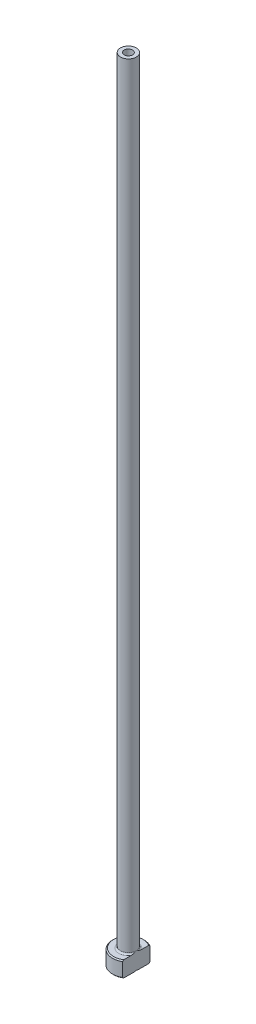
ISO-10303-21;
HEADER;
FILE_DESCRIPTION(('STEP AP214'),'2;1');
FILE_NAME('part.step','',(''),(''),'','','');
FILE_SCHEMA(('AUTOMOTIVE_DESIGN { 1 0 10303 214 1 1 1 1 }'));
ENDSEC;
DATA;
#1=APPLICATION_CONTEXT('core data for automotive mechanical design processes');
#2=APPLICATION_PROTOCOL_DEFINITION('international standard','automotive_design',2000,#1);
#3=PRODUCT_CONTEXT('',#1,'mechanical');
#4=PRODUCT('Part','Part','',(#3));
#5=PRODUCT_RELATED_PRODUCT_CATEGORY('part','',(#4));
#6=PRODUCT_DEFINITION_FORMATION('','',#4);
#7=PRODUCT_DEFINITION_CONTEXT('part definition',#1,'design');
#8=PRODUCT_DEFINITION('design','',#6,#7);
#9=PRODUCT_DEFINITION_SHAPE('','',#8);
#10=(LENGTH_UNIT() NAMED_UNIT(*) SI_UNIT(.MILLI.,.METRE.));
#11=(NAMED_UNIT(*) PLANE_ANGLE_UNIT() SI_UNIT($,.RADIAN.));
#12=(NAMED_UNIT(*) SI_UNIT($,.STERADIAN.) SOLID_ANGLE_UNIT());
#13=UNCERTAINTY_MEASURE_WITH_UNIT(LENGTH_MEASURE(1.E-05),#10,'distance_accuracy_value','');
#14=(GEOMETRIC_REPRESENTATION_CONTEXT(3) GLOBAL_UNCERTAINTY_ASSIGNED_CONTEXT((#13)) GLOBAL_UNIT_ASSIGNED_CONTEXT((#10,
#11,#12)) REPRESENTATION_CONTEXT('',''));
#15=CARTESIAN_POINT('',(0.,0.,0.));
#16=DIRECTION('',(0.,0.,1.));
#17=DIRECTION('',(1.,0.,0.));
#18=AXIS2_PLACEMENT_3D('',#15,#16,#17);
#19=CARTESIAN_POINT('',(0.,92.1876809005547,0.));
#20=DIRECTION('',(0.,1.,0.));
#21=DIRECTION('',(0.,0.,1.));
#22=AXIS2_PLACEMENT_3D('',#19,#20,#21);
#23=CYLINDRICAL_SURFACE('',#22,0.8);
#24=CARTESIAN_POINT('',(0.,150.,0.));
#25=DIRECTION('',(0.,1.,0.));
#26=DIRECTION('',(0.,0.,1.));
#27=AXIS2_PLACEMENT_3D('',#24,#25,#26);
#28=CIRCLE('',#27,0.8);
#29=CARTESIAN_POINT('',(0.,150.,0.8));
#30=VERTEX_POINT('',#29);
#31=EDGE_CURVE('E181',#30,#30,#28,.T.);
#32=ORIENTED_EDGE('',*,*,#31,.T.);
#33=EDGE_LOOP('',(#32));
#34=FACE_BOUND('',#33,.T.);
#35=CARTESIAN_POINT('',(0.,115.,0.));
#36=DIRECTION('',(0.,1.,0.));
#37=DIRECTION('',(0.,0.,1.));
#38=AXIS2_PLACEMENT_3D('',#35,#36,#37);
#39=CIRCLE('',#38,0.8);
#40=CARTESIAN_POINT('',(0.,115.,0.8));
#41=VERTEX_POINT('',#40);
#42=EDGE_CURVE('E152',#41,#41,#39,.T.);
#43=ORIENTED_EDGE('',*,*,#42,.F.);
#44=EDGE_LOOP('',(#43));
#45=FACE_BOUND('',#44,.T.);
#46=ADVANCED_FACE('F32',(#34,#45),#23,.F.);
#47=CARTESIAN_POINT('',(-0.8,150.,0.));
#48=DIRECTION('',(0.,1.,0.));
#49=DIRECTION('',(0.,0.,1.));
#50=AXIS2_PLACEMENT_3D('',#47,#48,#49);
#51=PLANE('',#50);
#52=CARTESIAN_POINT('',(0.,150.,0.));
#53=DIRECTION('',(0.,1.,0.));
#54=DIRECTION('',(0.,0.,1.));
#55=AXIS2_PLACEMENT_3D('',#52,#53,#54);
#56=CIRCLE('',#55,1.50000000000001);
#57=CARTESIAN_POINT('',(0.,150.,1.50000000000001));
#58=VERTEX_POINT('',#57);
#59=EDGE_CURVE('E187',#58,#58,#56,.T.);
#60=ORIENTED_EDGE('',*,*,#59,.T.);
#61=EDGE_LOOP('',(#60));
#62=FACE_BOUND('',#61,.T.);
#63=ORIENTED_EDGE('',*,*,#31,.F.);
#64=EDGE_LOOP('',(#63));
#65=FACE_BOUND('',#64,.T.);
#66=ADVANCED_FACE('F171',(#62,#65),#51,.T.);
#67=CARTESIAN_POINT('',(0.,92.1876809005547,0.));
#68=DIRECTION('',(0.,1.,0.));
#69=DIRECTION('',(0.,0.,1.));
#70=AXIS2_PLACEMENT_3D('',#67,#68,#69);
#71=CYLINDRICAL_SURFACE('',#70,1.5);
#72=CARTESIAN_POINT('',(0.,3.3,0.));
#73=DIRECTION('',(0.,1.,0.));
#74=DIRECTION('',(0.,0.,1.));
#75=AXIS2_PLACEMENT_3D('',#72,#73,#74);
#76=CIRCLE('',#75,1.5);
#77=CARTESIAN_POINT('',(1.5,3.3,0.));
#78=VERTEX_POINT('',#77);
#79=EDGE_CURVE('E194',#78,#78,#76,.T.);
#80=ORIENTED_EDGE('',*,*,#79,.T.);
#81=EDGE_LOOP('',(#80));
#82=FACE_BOUND('',#81,.T.);
#83=ORIENTED_EDGE('',*,*,#59,.F.);
#84=EDGE_LOOP('',(#83));
#85=FACE_BOUND('',#84,.T.);
#86=ADVANCED_FACE('F176',(#82,#85),#71,.T.);
#87=CARTESIAN_POINT('',(-1.49999999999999,3.,0.));
#88=DIRECTION('',(0.,1.,0.));
#89=DIRECTION('',(0.,0.,1.));
#90=AXIS2_PLACEMENT_3D('',#87,#88,#89);
#91=PLANE('',#90);
#92=DIRECTION('',(0.,0.,1.));
#93=VECTOR('',#92,1.);
#94=CARTESIAN_POINT('',(1.49999999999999,3.,0.));
#95=LINE('',#94,#93);
#96=CARTESIAN_POINT('',(1.5,3.,-2.36431808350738));
#97=VERTEX_POINT('',#96);
#98=CARTESIAN_POINT('',(1.49999999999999,3.,-0.994987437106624));
#99=VERTEX_POINT('',#98);
#100=EDGE_CURVE('E153',#97,#99,#95,.T.);
#101=ORIENTED_EDGE('',*,*,#100,.F.);
#102=CARTESIAN_POINT('',(0.,3.,0.));
#103=DIRECTION('',(0.,1.,0.));
#104=DIRECTION('',(0.,0.,1.));
#105=AXIS2_PLACEMENT_3D('',#102,#103,#104);
#106=CIRCLE('',#105,2.8);
#107=CARTESIAN_POINT('',(1.49999999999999,2.99999999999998,2.36431808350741));
#108=VERTEX_POINT('',#107);
#109=EDGE_CURVE('E200',#97,#108,#106,.T.);
#110=ORIENTED_EDGE('',*,*,#109,.T.);
#111=CARTESIAN_POINT('',(1.49999999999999,3.,0.994987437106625));
#112=VERTEX_POINT('',#111);
#113=EDGE_CURVE('E208',#112,#108,#95,.T.);
#114=ORIENTED_EDGE('',*,*,#113,.F.);
#115=CARTESIAN_POINT('',(0.,3.,0.));
#116=DIRECTION('',(0.,1.,0.));
#117=DIRECTION('',(0.,0.,1.));
#118=AXIS2_PLACEMENT_3D('',#115,#116,#117);
#119=CIRCLE('',#118,1.8);
#120=EDGE_CURVE('E197',#112,#99,#119,.F.);
#121=ORIENTED_EDGE('',*,*,#120,.T.);
#122=EDGE_LOOP('',(#101,#110,#114,#121));
#123=FACE_BOUND('',#122,.T.);
#124=ADVANCED_FACE('F219',(#123),#91,.T.);
#125=CARTESIAN_POINT('',(0.,92.1876809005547,0.));
#126=DIRECTION('',(0.,1.,0.));
#127=DIRECTION('',(0.,0.,1.));
#128=AXIS2_PLACEMENT_3D('',#125,#126,#127);
#129=CYLINDRICAL_SURFACE('',#128,2.99999999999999);
#130=DIRECTION('',(0.,-1.,0.));
#131=VECTOR('',#130,1.);
#132=CARTESIAN_POINT('',(1.49999999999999,150.,2.59807621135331));
#133=LINE('',#132,#131);
#134=CARTESIAN_POINT('',(1.49999999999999,2.80000000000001,2.59807621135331));
#135=VERTEX_POINT('',#134);
#136=CARTESIAN_POINT('',(1.49999999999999,0.200000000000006,2.59807621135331));
#137=VERTEX_POINT('',#136);
#138=EDGE_CURVE('E90',#135,#137,#133,.T.);
#139=ORIENTED_EDGE('',*,*,#138,.F.);
#140=CARTESIAN_POINT('',(0.,2.80000000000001,0.));
#141=DIRECTION('',(0.,1.,0.));
#142=DIRECTION('',(0.,0.,1.));
#143=AXIS2_PLACEMENT_3D('',#140,#141,#142);
#144=CIRCLE('',#143,2.99999999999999);
#145=CARTESIAN_POINT('',(1.5,2.80000000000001,-2.59807621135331));
#146=VERTEX_POINT('',#145);
#147=EDGE_CURVE('E106',#135,#146,#144,.F.);
#148=ORIENTED_EDGE('',*,*,#147,.T.);
#149=DIRECTION('',(0.,-1.,0.));
#150=VECTOR('',#149,1.);
#151=CARTESIAN_POINT('',(1.5,150.,-2.59807621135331));
#152=LINE('',#151,#150);
#153=CARTESIAN_POINT('',(1.5,0.200000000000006,-2.59807621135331));
#154=VERTEX_POINT('',#153);
#155=EDGE_CURVE('E206',#146,#154,#152,.T.);
#156=ORIENTED_EDGE('',*,*,#155,.T.);
#157=CARTESIAN_POINT('',(0.,0.200000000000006,0.));
#158=DIRECTION('',(0.,-1.,0.));
#159=DIRECTION('',(0.,0.,-1.));
#160=AXIS2_PLACEMENT_3D('',#157,#158,#159);
#161=CIRCLE('',#160,2.99999999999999);
#162=EDGE_CURVE('E109',#154,#137,#161,.F.);
#163=ORIENTED_EDGE('',*,*,#162,.T.);
#164=EDGE_LOOP('',(#139,#148,#156,#163));
#165=FACE_BOUND('',#164,.T.);
#166=ADVANCED_FACE('F204',(#165),#129,.T.);
#167=CARTESIAN_POINT('',(-2.99999999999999,0.,0.));
#168=DIRECTION('',(0.,-1.,0.));
#169=DIRECTION('',(0.,0.,-1.));
#170=AXIS2_PLACEMENT_3D('',#167,#168,#169);
#171=PLANE('',#170);
#172=DIRECTION('',(0.,0.,-1.));
#173=VECTOR('',#172,1.);
#174=CARTESIAN_POINT('',(1.49999999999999,0.,2.59807621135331));
#175=LINE('',#174,#173);
#176=CARTESIAN_POINT('',(1.49999999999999,0.,-0.390512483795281));
#177=VERTEX_POINT('',#176);
#178=CARTESIAN_POINT('',(1.5,0.,-2.36431808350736));
#179=VERTEX_POINT('',#178);
#180=EDGE_CURVE('E102',#177,#179,#175,.T.);
#181=ORIENTED_EDGE('',*,*,#180,.F.);
#182=CARTESIAN_POINT('',(0.,0.,0.));
#183=DIRECTION('',(0.,-1.,0.));
#184=DIRECTION('',(0.,0.,-1.));
#185=AXIS2_PLACEMENT_3D('',#182,#183,#184);
#186=CIRCLE('',#185,1.54999999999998);
#187=CARTESIAN_POINT('',(1.49999999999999,0.,0.390512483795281));
#188=VERTEX_POINT('',#187);
#189=EDGE_CURVE('E95',#177,#188,#186,.F.);
#190=ORIENTED_EDGE('',*,*,#189,.T.);
#191=CARTESIAN_POINT('',(1.49999999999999,0.,2.36431808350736));
#192=VERTEX_POINT('',#191);
#193=EDGE_CURVE('E88',#192,#188,#175,.T.);
#194=ORIENTED_EDGE('',*,*,#193,.F.);
#195=CARTESIAN_POINT('',(0.,0.,0.));
#196=DIRECTION('',(0.,-1.,0.));
#197=DIRECTION('',(0.,0.,-1.));
#198=AXIS2_PLACEMENT_3D('',#195,#196,#197);
#199=CIRCLE('',#198,2.79999999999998);
#200=EDGE_CURVE('E101',#192,#179,#199,.T.);
#201=ORIENTED_EDGE('',*,*,#200,.T.);
#202=EDGE_LOOP('',(#181,#190,#194,#201));
#203=FACE_BOUND('',#202,.T.);
#204=ADVANCED_FACE('F100',(#203),#171,.T.);
#205=CARTESIAN_POINT('',(0.,92.1876809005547,0.));
#206=DIRECTION('',(0.,1.,0.));
#207=DIRECTION('',(0.,0.,1.));
#208=AXIS2_PLACEMENT_3D('',#205,#206,#207);
#209=CYLINDRICAL_SURFACE('',#208,1.05);
#210=CARTESIAN_POINT('',(0.,0.5,0.));
#211=DIRECTION('',(0.,-1.,0.));
#212=DIRECTION('',(0.,0.,-1.));
#213=AXIS2_PLACEMENT_3D('',#210,#211,#212);
#214=CIRCLE('',#213,1.05);
#215=CARTESIAN_POINT('',(0.,0.5,-1.05));
#216=VERTEX_POINT('',#215);
#217=EDGE_CURVE('E11',#216,#216,#214,.T.);
#218=ORIENTED_EDGE('',*,*,#217,.T.);
#219=EDGE_LOOP('',(#218));
#220=FACE_BOUND('',#219,.T.);
#221=CARTESIAN_POINT('',(0.,103.,0.));
#222=DIRECTION('',(0.,1.,0.));
#223=DIRECTION('',(0.,0.,1.));
#224=AXIS2_PLACEMENT_3D('',#221,#222,#223);
#225=CIRCLE('',#224,1.05);
#226=CARTESIAN_POINT('',(0.,103.,1.05));
#227=VERTEX_POINT('',#226);
#228=EDGE_CURVE('E185',#227,#227,#225,.T.);
#229=ORIENTED_EDGE('',*,*,#228,.T.);
#230=EDGE_LOOP('',(#229));
#231=FACE_BOUND('',#230,.T.);
#232=ADVANCED_FACE('F232',(#220,#231),#209,.F.);
#233=CARTESIAN_POINT('',(0.,103.,0.));
#234=DIRECTION('',(0.,-1.,0.));
#235=DIRECTION('',(0.,0.,-1.));
#236=AXIS2_PLACEMENT_3D('',#233,#234,#235);
#237=CONICAL_SURFACE('',#236,1.05,0.0208303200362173);
#238=ORIENTED_EDGE('',*,*,#42,.T.);
#239=EDGE_LOOP('',(#238));
#240=FACE_BOUND('',#239,.T.);
#241=ORIENTED_EDGE('',*,*,#228,.F.);
#242=EDGE_LOOP('',(#241));
#243=FACE_BOUND('',#242,.T.);
#244=ADVANCED_FACE('F123',(#240,#243),#237,.F.);
#245=CARTESIAN_POINT('',(0.,3.3,0.));
#246=DIRECTION('',(0.,1.,0.));
#247=DIRECTION('',(0.,0.,1.));
#248=AXIS2_PLACEMENT_3D('',#245,#246,#247);
#249=TOROIDAL_SURFACE('',#248,1.8,0.3);
#250=ORIENTED_EDGE('',*,*,#120,.F.);
#251=CARTESIAN_POINT('',(1.5,3.3,0.));
#252=CARTESIAN_POINT('',(1.5,3.30000063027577,-3.4193899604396E-12));
#253=CARTESIAN_POINT('',(1.5,3.30000126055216,1.15373666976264E-07));
#254=CARTESIAN_POINT('',(1.5,3.30000248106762,4.90631662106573E-07));
#255=CARTESIAN_POINT('',(1.5,3.30000307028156,7.53296792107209E-07));
#256=CARTESIAN_POINT('',(1.5,3.30000424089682,1.38757115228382E-06));
#257=CARTESIAN_POINT('',(1.5,3.30000481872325,1.76563024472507E-06));
#258=CARTESIAN_POINT('',(1.5,3.30000591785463,2.58768036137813E-06));
#259=CARTESIAN_POINT('',(1.5,3.30000643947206,3.03127045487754E-06));
#260=CARTESIAN_POINT('',(1.5,3.30000815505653,4.60022013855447E-06));
#261=CARTESIAN_POINT('',(1.5,3.30000927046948,5.81241577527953E-06));
#262=CARTESIAN_POINT('',(1.5,3.30001128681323,8.33989483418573E-06));
#263=CARTESIAN_POINT('',(1.5,3.3000121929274,9.65128228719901E-06));
#264=CARTESIAN_POINT('',(1.5,3.30001551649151,1.46782517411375E-05));
#265=CARTESIAN_POINT('',(1.5,3.30001775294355,1.85179784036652E-05));
#266=CARTESIAN_POINT('',(1.5,3.3000214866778,2.61616212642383E-05));
#267=CARTESIAN_POINT('',(1.5,3.30002302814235,2.99447760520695E-05));
#268=CARTESIAN_POINT('',(1.5,3.30002943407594,4.58003773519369E-05));
#269=CARTESIAN_POINT('',(1.5,3.30003419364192,5.79079117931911E-05));
#270=CARTESIAN_POINT('',(1.5,3.30004197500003,8.07263804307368E-05));
#271=CARTESIAN_POINT('',(1.5,3.30004514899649,9.13834757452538E-05));
#272=CARTESIAN_POINT('',(1.49999999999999,3.30006989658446,0.000167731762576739));
#273=CARTESIAN_POINT('',(1.49999999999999,3.30010092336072,0.000229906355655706));
#274=CARTESIAN_POINT('',(1.5,3.30021632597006,0.000470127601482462));
#275=CARTESIAN_POINT('',(1.5,3.3002936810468,0.000650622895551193));
#276=CARTESIAN_POINT('',(1.49999999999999,3.30059619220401,0.00134589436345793));
#277=CARTESIAN_POINT('',(1.49999999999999,3.30082870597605,0.00185814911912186));
#278=CARTESIAN_POINT('',(1.5,3.30176696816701,0.00393547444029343));
#279=CARTESIAN_POINT('',(1.5,3.30246445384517,0.00550332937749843));
#280=CARTESIAN_POINT('',(1.49999999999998,3.3142678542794,0.0320229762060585));
#281=CARTESIAN_POINT('',(1.49999999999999,3.32544800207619,0.0569503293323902));
#282=CARTESIAN_POINT('',(1.5,3.34725700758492,0.105984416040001));
#283=CARTESIAN_POINT('',(1.5,3.35789134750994,0.130088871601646));
#284=CARTESIAN_POINT('',(1.49999999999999,3.38015321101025,0.181096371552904));
#285=CARTESIAN_POINT('',(1.49999999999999,3.39175804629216,0.208009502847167));
#286=CARTESIAN_POINT('',(1.5,3.41469034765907,0.262264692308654));
#287=CARTESIAN_POINT('',(1.49999999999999,3.42601398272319,0.289608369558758));
#288=CARTESIAN_POINT('',(1.49999999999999,3.45363212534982,0.358203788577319));
#289=CARTESIAN_POINT('',(1.49999999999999,3.46959026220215,0.399592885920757));
#290=CARTESIAN_POINT('',(1.49999999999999,3.49940505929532,0.482097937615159));
#291=CARTESIAN_POINT('',(1.49999999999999,3.51330033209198,0.523199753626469));
#292=CARTESIAN_POINT('',(1.49999999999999,3.5355250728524,0.595497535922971));
#293=CARTESIAN_POINT('',(1.49999999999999,3.54436834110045,0.626532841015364));
#294=CARTESIAN_POINT('',(1.49999999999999,3.56052427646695,0.689176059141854));
#295=CARTESIAN_POINT('',(1.49999999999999,3.56782794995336,0.720786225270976));
#296=CARTESIAN_POINT('',(1.49999999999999,3.5875075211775,0.819524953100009));
#297=CARTESIAN_POINT('',(1.49999999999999,3.59661044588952,0.887429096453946));
#298=CARTESIAN_POINT('',(1.49999999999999,3.60059842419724,0.99118029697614));
#299=CARTESIAN_POINT('',(1.49999999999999,3.60019840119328,1.02684364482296));
#300=CARTESIAN_POINT('',(1.49999999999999,3.5949708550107,1.09750559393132));
#301=CARTESIAN_POINT('',(1.49999999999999,3.5901929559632,1.13250716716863));
#302=CARTESIAN_POINT('',(1.49999999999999,3.57687734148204,1.19353096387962));
#303=CARTESIAN_POINT('',(1.49999999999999,3.56943875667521,1.21978854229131));
#304=CARTESIAN_POINT('',(1.49999999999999,3.55063748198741,1.27094658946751));
#305=CARTESIAN_POINT('',(1.49999999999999,3.53927342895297,1.29584658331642));
#306=CARTESIAN_POINT('',(1.49999999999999,3.51660016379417,1.33501873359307));
#307=CARTESIAN_POINT('',(1.49999999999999,3.50657738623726,1.35003296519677));
#308=CARTESIAN_POINT('',(1.49999999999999,3.48437469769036,1.37837252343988));
#309=CARTESIAN_POINT('',(1.49999999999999,3.47219867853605,1.39170082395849));
#310=CARTESIAN_POINT('',(1.49999999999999,3.44835614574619,1.41349417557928));
#311=CARTESIAN_POINT('',(1.49999999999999,3.43709185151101,1.42239673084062));
#312=CARTESIAN_POINT('',(1.49999999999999,3.41325256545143,1.43825467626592));
#313=CARTESIAN_POINT('',(1.49999999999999,3.40067804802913,1.44521076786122));
#314=CARTESIAN_POINT('',(1.49999999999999,3.37433767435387,1.45677158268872));
#315=CARTESIAN_POINT('',(1.49999999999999,3.36056203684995,1.46135438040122));
#316=CARTESIAN_POINT('',(1.49999999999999,3.33237324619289,1.46767730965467));
#317=CARTESIAN_POINT('',(1.49999999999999,3.31796076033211,1.46942034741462));
#318=CARTESIAN_POINT('',(1.49999999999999,3.29122479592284,1.46987207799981));
#319=CARTESIAN_POINT('',(1.49999999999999,3.2789066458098,1.46899029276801));
#320=CARTESIAN_POINT('',(1.49999999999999,3.25461019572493,1.4651157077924));
#321=CARTESIAN_POINT('',(1.49999999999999,3.24263187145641,1.46212305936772));
#322=CARTESIAN_POINT('',(1.49999999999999,3.2195968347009,1.4543117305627));
#323=CARTESIAN_POINT('',(1.49999999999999,3.20852542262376,1.44953579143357));
#324=CARTESIAN_POINT('',(1.49999999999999,3.18721125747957,1.43840957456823));
#325=CARTESIAN_POINT('',(1.49999999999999,3.17696878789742,1.43205876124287));
#326=CARTESIAN_POINT('',(1.49999999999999,3.15325976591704,1.41506353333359));
#327=CARTESIAN_POINT('',(1.49999999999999,3.14027750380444,1.40374235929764));
#328=CARTESIAN_POINT('',(1.49999999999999,3.11630720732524,1.37914825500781));
#329=CARTESIAN_POINT('',(1.49999999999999,3.10532420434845,1.36587054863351));
#330=CARTESIAN_POINT('',(1.49999999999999,3.08100891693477,1.33197272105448));
#331=CARTESIAN_POINT('',(1.49999999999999,3.0686762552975,1.3106384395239));
#332=CARTESIAN_POINT('',(1.49999999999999,3.04751867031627,1.26637455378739));
#333=CARTESIAN_POINT('',(1.49999999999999,3.038692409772,1.24344556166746));
#334=CARTESIAN_POINT('',(1.49999999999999,3.0197836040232,1.18316534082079));
#335=CARTESIAN_POINT('',(1.49999999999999,3.01191472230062,1.14512623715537));
#336=CARTESIAN_POINT('',(1.49999999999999,3.0018828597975,1.06789971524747));
#337=CARTESIAN_POINT('',(1.49999999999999,2.99979735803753,1.02870374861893));
#338=CARTESIAN_POINT('',(1.49999999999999,3.00021727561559,0.953160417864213));
#339=CARTESIAN_POINT('',(1.49999999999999,3.00240673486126,0.916808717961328));
#340=CARTESIAN_POINT('',(1.49999999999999,3.00996433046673,0.844432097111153));
#341=CARTESIAN_POINT('',(1.49999999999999,3.01533462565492,0.808407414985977));
#342=CARTESIAN_POINT('',(1.49999999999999,3.02828086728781,0.738670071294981));
#343=CARTESIAN_POINT('',(1.49999999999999,3.03573028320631,0.704933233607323));
#344=CARTESIAN_POINT('',(1.49999999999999,3.05243174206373,0.63812804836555));
#345=CARTESIAN_POINT('',(1.49999999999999,3.06167285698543,0.60505692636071));
#346=CARTESIAN_POINT('',(1.49999999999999,3.08440652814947,0.530195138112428));
#347=CARTESIAN_POINT('',(1.49999999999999,3.0983657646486,0.488547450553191));
#348=CARTESIAN_POINT('',(1.49999999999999,3.12838209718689,0.404954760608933));
#349=CARTESIAN_POINT('',(1.49999999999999,3.14447968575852,0.363024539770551));
#350=CARTESIAN_POINT('',(1.5,3.17238454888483,0.293508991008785));
#351=CARTESIAN_POINT('',(1.5,3.18384249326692,0.265781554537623));
#352=CARTESIAN_POINT('',(1.49999999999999,3.2070585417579,0.210769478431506));
#353=CARTESIAN_POINT('',(1.49999999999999,3.21881265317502,0.183483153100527));
#354=CARTESIAN_POINT('',(1.5,3.24136702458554,0.131772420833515));
#355=CARTESIAN_POINT('',(1.5,3.2521436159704,0.107337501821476));
#356=CARTESIAN_POINT('',(1.49999999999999,3.2742474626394,0.057632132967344));
#357=CARTESIAN_POINT('',(1.49999999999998,3.28558038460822,0.0323640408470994));
#358=CARTESIAN_POINT('',(1.5,3.29753556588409,0.00550327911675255));
#359=CARTESIAN_POINT('',(1.5,3.29823307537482,0.00393537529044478));
#360=CARTESIAN_POINT('',(1.49999999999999,3.29917134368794,0.00185803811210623));
#361=CARTESIAN_POINT('',(1.49999999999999,3.29940384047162,0.00134582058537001));
#362=CARTESIAN_POINT('',(1.5,3.2997063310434,0.00065059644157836));
#363=CARTESIAN_POINT('',(1.5,3.29978368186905,0.000470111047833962));
#364=CARTESIAN_POINT('',(1.49999999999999,3.29989907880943,0.000229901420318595));
#365=CARTESIAN_POINT('',(1.49999999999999,3.29993010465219,0.000167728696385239));
#366=CARTESIAN_POINT('',(1.5,3.2999548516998,9.13825741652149E-05));
#367=CARTESIAN_POINT('',(1.5,3.29995802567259,8.07256293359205E-05));
#368=CARTESIAN_POINT('',(1.5,3.29996580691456,5.79074863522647E-05));
#369=CARTESIAN_POINT('',(1.5,3.29997056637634,4.58001230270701E-05));
#370=CARTESIAN_POINT('',(1.5,3.29997697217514,2.99447140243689E-05));
#371=CARTESIAN_POINT('',(1.5,3.2999785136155,2.61615837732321E-05));
#372=CARTESIAN_POINT('',(1.5,3.29998224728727,1.85179862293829E-05));
#373=CARTESIAN_POINT('',(1.5,3.2999844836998,1.4678279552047E-05));
#374=CARTESIAN_POINT('',(1.5,3.2999878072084,9.65132837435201E-06));
#375=CARTESIAN_POINT('',(1.5,3.29998871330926,8.33994284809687E-06));
#376=CARTESIAN_POINT('',(1.5,3.29999072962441,5.81246495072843E-06));
#377=CARTESIAN_POINT('',(1.5,3.29999184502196,4.60026844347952E-06));
#378=CARTESIAN_POINT('',(1.5,3.29999356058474,3.03131433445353E-06));
#379=CARTESIAN_POINT('',(1.5,3.2999940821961,2.58772232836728E-06));
#380=CARTESIAN_POINT('',(1.5,3.29999518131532,1.76566730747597E-06));
#381=CARTESIAN_POINT('',(1.5,3.29999575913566,1.3876052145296E-06));
#382=CARTESIAN_POINT('',(1.5,3.2999969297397,7.53323585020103E-07));
#383=CARTESIAN_POINT('',(1.5,3.2999975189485,4.90654307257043E-07));
#384=CARTESIAN_POINT('',(1.5,3.29999873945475,1.15386308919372E-07));
#385=CARTESIAN_POINT('',(1.5,3.29999936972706,3.41962499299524E-12));
#386=CARTESIAN_POINT('',(1.5,3.3,0.));
#387=B_SPLINE_CURVE_WITH_KNOTS('',3,(#251,#252,#253,#254,#255,#256,#257,#258,#259,#260,#261,
#262,#263,#264,#265,#266,#267,#268,#269,#270,#271,#272,#273,#274,#275,#276,#277,#278,#279,#280,
#281,#282,#283,#284,#285,#286,#287,#288,#289,#290,#291,#292,#293,#294,#295,#296,#297,#298,#299,
#300,#301,#302,#303,#304,#305,#306,#307,#308,#309,#310,#311,#312,#313,#314,#315,#316,#317,#318,
#319,#320,#321,#322,#323,#324,#325,#326,#327,#328,#329,#330,#331,#332,#333,#334,#335,#336,#337,
#338,#339,#340,#341,#342,#343,#344,#345,#346,#347,#348,#349,#350,#351,#352,#353,#354,#355,#356,
#357,#358,#359,#360,#361,#362,#363,#364,#365,#366,#367,#368,#369,#370,#371,#372,#373,#374,#375,
#376,#377,#378,#379,#380,#381,#382,#383,#384,#385,#386),.UNSPECIFIED.,.T.,.F.,(4,2,2,2,2,2,2,2,
2,2,2,2,2,2,2,2,2,2,2,2,2,2,2,2,2,2,2,2,2,2,2,2,2,2,2,2,2,2,2,2,2,2,2,2,2,2,2,2,2,2,2,2,2,2,2,2,
2,2,2,2,2,2,2,2,2,2,2,4),(0.,1.88905974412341E-06,3.81509471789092E-06,5.87892670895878E-06,
7.93061809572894E-06,1.28480863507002E-05,1.76261683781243E-05,3.09099150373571E-05,
4.3152970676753E-05,8.21699299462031E-05,0.00011549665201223,0.000323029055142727,
0.000912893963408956,0.00259963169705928,0.00774858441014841,0.0896975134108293,
0.168737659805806,0.256660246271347,0.345444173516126,0.47849253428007,0.608603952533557,
0.70537288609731,0.802692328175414,1.00719557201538,1.11399616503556,1.21960092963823,
1.30124317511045,1.38291380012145,1.43690814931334,1.49080588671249,1.53371524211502,
1.57660911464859,1.61989249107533,1.66313154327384,1.69999492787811,1.73685567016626,
1.77288440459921,1.80892540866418,1.86031324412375,1.91182866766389,1.98534297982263,
2.05882922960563,2.17471722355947,2.29215041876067,2.40123170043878,2.51038710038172,
2.61397263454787,2.71694519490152,2.84866234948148,2.98337525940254,3.07337666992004,
3.16250453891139,3.24262397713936,3.32569301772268,3.33084213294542,3.33252874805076,
3.33311858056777,3.3333261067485,3.3333594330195,3.33339844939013,3.33341069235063,
3.33342397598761,3.33342875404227,3.33343367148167,3.33343572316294,3.33343778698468,
3.33343971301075,3.33344160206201),.UNSPECIFIED.);
#388=EDGE_CURVE('E138',#112,#78,#387,.T.);
#389=ORIENTED_EDGE('',*,*,#388,.T.);
#390=ORIENTED_EDGE('',*,*,#79,.F.);
#391=CARTESIAN_POINT('',(1.5,3.3,0.));
#392=CARTESIAN_POINT('',(1.5,3.29999936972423,3.41971501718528E-12));
#393=CARTESIAN_POINT('',(1.5,3.29999873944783,-1.15373666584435E-07));
#394=CARTESIAN_POINT('',(1.5,3.29999751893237,-4.90631661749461E-07));
#395=CARTESIAN_POINT('',(1.5,3.29999692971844,-7.53296791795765E-07));
#396=CARTESIAN_POINT('',(1.5,3.29999575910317,-1.38757115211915E-06));
#397=CARTESIAN_POINT('',(1.5,3.29999518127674,-1.76563024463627E-06));
#398=CARTESIAN_POINT('',(1.5,3.29999408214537,-2.58768036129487E-06));
#399=CARTESIAN_POINT('',(1.5,3.29999356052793,-3.03127045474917E-06));
#400=CARTESIAN_POINT('',(1.5,3.29999184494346,-4.60022013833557E-06));
#401=CARTESIAN_POINT('',(1.5,3.29999072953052,-5.81241577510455E-06));
#402=CARTESIAN_POINT('',(1.5,3.29998871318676,-8.33989483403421E-06));
#403=CARTESIAN_POINT('',(1.5,3.2999878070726,-9.65128228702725E-06));
#404=CARTESIAN_POINT('',(1.5,3.29998448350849,-1.46782517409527E-05));
#405=CARTESIAN_POINT('',(1.5,3.29998224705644,-1.85179784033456E-05));
#406=CARTESIAN_POINT('',(1.5,3.29997851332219,-2.61616212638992E-05));
#407=CARTESIAN_POINT('',(1.5,3.29997697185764,-2.99447760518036E-05));
#408=CARTESIAN_POINT('',(1.5,3.29997056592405,-4.58003773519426E-05));
#409=CARTESIAN_POINT('',(1.5,3.29996580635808,-5.79079117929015E-05));
#410=CARTESIAN_POINT('',(1.5,3.29995802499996,-8.07263804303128E-05));
#411=CARTESIAN_POINT('',(1.5,3.29995485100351,-9.13834757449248E-05));
#412=CARTESIAN_POINT('',(1.49999999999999,3.29993010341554,-0.000167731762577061));
#413=CARTESIAN_POINT('',(1.49999999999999,3.29989907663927,-0.000229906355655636));
#414=CARTESIAN_POINT('',(1.5,3.29978367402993,-0.000470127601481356));
#415=CARTESIAN_POINT('',(1.5,3.2997063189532,-0.000650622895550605));
#416=CARTESIAN_POINT('',(1.49999999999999,3.29940380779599,-0.00134589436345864));
#417=CARTESIAN_POINT('',(1.49999999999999,3.29917129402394,-0.00185814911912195));
#418=CARTESIAN_POINT('',(1.5,3.29823303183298,-0.003935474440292));
#419=CARTESIAN_POINT('',(1.5,3.29753554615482,-0.0055033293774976));
#420=CARTESIAN_POINT('',(1.49999999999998,3.28573214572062,-0.0320229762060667));
#421=CARTESIAN_POINT('',(1.49999999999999,3.27455199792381,-0.0569503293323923));
#422=CARTESIAN_POINT('',(1.5,3.25274299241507,-0.105984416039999));
#423=CARTESIAN_POINT('',(1.5,3.24210865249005,-0.130088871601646));
#424=CARTESIAN_POINT('',(1.49999999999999,3.21984678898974,-0.181096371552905));
#425=CARTESIAN_POINT('',(1.49999999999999,3.20824195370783,-0.208009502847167));
#426=CARTESIAN_POINT('',(1.5,3.18530965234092,-0.262264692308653));
#427=CARTESIAN_POINT('',(1.5,3.17398601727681,-0.289608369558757));
#428=CARTESIAN_POINT('',(1.49999999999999,3.14636787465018,-0.358203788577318));
#429=CARTESIAN_POINT('',(1.49999999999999,3.13040973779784,-0.399592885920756));
#430=CARTESIAN_POINT('',(1.49999999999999,3.10059494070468,-0.482097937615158));
#431=CARTESIAN_POINT('',(1.49999999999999,3.08669966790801,-0.523199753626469));
#432=CARTESIAN_POINT('',(1.49999999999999,3.06447492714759,-0.595497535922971));
#433=CARTESIAN_POINT('',(1.49999999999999,3.05563165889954,-0.626532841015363));
#434=CARTESIAN_POINT('',(1.49999999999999,3.03947572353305,-0.689176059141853));
#435=CARTESIAN_POINT('',(1.49999999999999,3.03217205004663,-0.720786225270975));
#436=CARTESIAN_POINT('',(1.49999999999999,3.0124924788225,-0.819524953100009));
#437=CARTESIAN_POINT('',(1.49999999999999,3.00338955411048,-0.887429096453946));
#438=CARTESIAN_POINT('',(1.49999999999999,2.99940157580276,-0.99118029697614));
#439=CARTESIAN_POINT('',(1.49999999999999,2.99980159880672,-1.02684364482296));
#440=CARTESIAN_POINT('',(1.49999999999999,3.0050291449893,-1.09750559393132));
#441=CARTESIAN_POINT('',(1.49999999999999,3.00980704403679,-1.13250716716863));
#442=CARTESIAN_POINT('',(1.49999999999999,3.02312265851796,-1.19353096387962));
#443=CARTESIAN_POINT('',(1.49999999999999,3.03056124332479,-1.21978854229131));
#444=CARTESIAN_POINT('',(1.49999999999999,3.04936251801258,-1.27094658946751));
#445=CARTESIAN_POINT('',(1.5,3.06072657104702,-1.29584658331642));
#446=CARTESIAN_POINT('',(1.5,3.08339983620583,-1.33501873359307));
#447=CARTESIAN_POINT('',(1.5,3.09342261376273,-1.35003296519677));
#448=CARTESIAN_POINT('',(1.5,3.11562530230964,-1.37837252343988));
#449=CARTESIAN_POINT('',(1.5,3.12780132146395,-1.39170082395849));
#450=CARTESIAN_POINT('',(1.5,3.15164385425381,-1.41349417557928));
#451=CARTESIAN_POINT('',(1.5,3.16290814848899,-1.42239673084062));
#452=CARTESIAN_POINT('',(1.5,3.18674743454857,-1.43825467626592));
#453=CARTESIAN_POINT('',(1.5,3.19932195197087,-1.44521076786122));
#454=CARTESIAN_POINT('',(1.5,3.22566232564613,-1.45677158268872));
#455=CARTESIAN_POINT('',(1.5,3.23943796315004,-1.46135438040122));
#456=CARTESIAN_POINT('',(1.5,3.26762675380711,-1.46767730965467));
#457=CARTESIAN_POINT('',(1.5,3.28203923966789,-1.46942034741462));
#458=CARTESIAN_POINT('',(1.5,3.30877520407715,-1.46987207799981));
#459=CARTESIAN_POINT('',(1.5,3.3210933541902,-1.46899029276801));
#460=CARTESIAN_POINT('',(1.5,3.34538980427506,-1.4651157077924));
#461=CARTESIAN_POINT('',(1.5,3.35736812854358,-1.46212305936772));
#462=CARTESIAN_POINT('',(1.5,3.38040316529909,-1.4543117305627));
#463=CARTESIAN_POINT('',(1.5,3.39147457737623,-1.44953579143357));
#464=CARTESIAN_POINT('',(1.5,3.41278874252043,-1.43840957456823));
#465=CARTESIAN_POINT('',(1.5,3.42303121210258,-1.43205876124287));
#466=CARTESIAN_POINT('',(1.5,3.44674023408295,-1.41506353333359));
#467=CARTESIAN_POINT('',(1.5,3.45972249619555,-1.40374235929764));
#468=CARTESIAN_POINT('',(1.5,3.48369279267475,-1.37914825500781));
#469=CARTESIAN_POINT('',(1.5,3.49467579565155,-1.36587054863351));
#470=CARTESIAN_POINT('',(1.5,3.51899108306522,-1.33197272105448));
#471=CARTESIAN_POINT('',(1.49999999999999,3.53132374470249,-1.3106384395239));
#472=CARTESIAN_POINT('',(1.49999999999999,3.55248132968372,-1.26637455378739));
#473=CARTESIAN_POINT('',(1.49999999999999,3.56130759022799,-1.24344556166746));
#474=CARTESIAN_POINT('',(1.49999999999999,3.5802163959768,-1.18316534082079));
#475=CARTESIAN_POINT('',(1.49999999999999,3.58808527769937,-1.14512623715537));
#476=CARTESIAN_POINT('',(1.49999999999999,3.5981171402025,-1.06789971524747));
#477=CARTESIAN_POINT('',(1.49999999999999,3.60020264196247,-1.02870374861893));
#478=CARTESIAN_POINT('',(1.49999999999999,3.59978272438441,-0.953160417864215));
#479=CARTESIAN_POINT('',(1.49999999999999,3.59759326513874,-0.916808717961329));
#480=CARTESIAN_POINT('',(1.49999999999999,3.59003566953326,-0.844432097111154));
#481=CARTESIAN_POINT('',(1.49999999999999,3.58466537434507,-0.808407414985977));
#482=CARTESIAN_POINT('',(1.49999999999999,3.57171913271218,-0.738670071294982));
#483=CARTESIAN_POINT('',(1.49999999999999,3.56426971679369,-0.704933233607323));
#484=CARTESIAN_POINT('',(1.49999999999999,3.54756825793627,-0.638128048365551));
#485=CARTESIAN_POINT('',(1.49999999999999,3.53832714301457,-0.60505692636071));
#486=CARTESIAN_POINT('',(1.49999999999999,3.51559347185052,-0.530195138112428));
#487=CARTESIAN_POINT('',(1.49999999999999,3.50163423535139,-0.488547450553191));
#488=CARTESIAN_POINT('',(1.49999999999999,3.4716179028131,-0.404954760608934));
#489=CARTESIAN_POINT('',(1.49999999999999,3.45552031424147,-0.363024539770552));
#490=CARTESIAN_POINT('',(1.5,3.42761545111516,-0.293508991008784));
#491=CARTESIAN_POINT('',(1.5,3.41615750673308,-0.265781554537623));
#492=CARTESIAN_POINT('',(1.49999999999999,3.39294145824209,-0.210769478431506));
#493=CARTESIAN_POINT('',(1.49999999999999,3.38118734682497,-0.183483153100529));
#494=CARTESIAN_POINT('',(1.5,3.35863297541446,-0.131772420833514));
#495=CARTESIAN_POINT('',(1.5,3.3478563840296,-0.107337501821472));
#496=CARTESIAN_POINT('',(1.49999999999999,3.32575253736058,-0.0576321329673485));
#497=CARTESIAN_POINT('',(1.49999999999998,3.31441961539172,-0.0323640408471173));
#498=CARTESIAN_POINT('',(1.5,3.30246443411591,-0.00550327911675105));
#499=CARTESIAN_POINT('',(1.5,3.30176692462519,-0.00393537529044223));
#500=CARTESIAN_POINT('',(1.49999999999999,3.30082865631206,-0.00185803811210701));
#501=CARTESIAN_POINT('',(1.49999999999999,3.30059615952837,-0.00134582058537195));
#502=CARTESIAN_POINT('',(1.5,3.3002936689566,-0.000650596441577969));
#503=CARTESIAN_POINT('',(1.5,3.30021631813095,-0.000470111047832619));
#504=CARTESIAN_POINT('',(1.49999999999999,3.30010092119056,-0.000229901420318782));
#505=CARTESIAN_POINT('',(1.49999999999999,3.3000698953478,-0.000167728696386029));
#506=CARTESIAN_POINT('',(1.5,3.3000451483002,-9.13825741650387E-05));
#507=CARTESIAN_POINT('',(1.5,3.3000419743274,-8.07256293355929E-05));
#508=CARTESIAN_POINT('',(1.5,3.30003419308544,-5.79074863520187E-05));
#509=CARTESIAN_POINT('',(1.5,3.30002943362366,-4.58001230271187E-05));
#510=CARTESIAN_POINT('',(1.5,3.30002302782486,-2.99447140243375E-05));
#511=CARTESIAN_POINT('',(1.5,3.30002148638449,-2.61615837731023E-05));
#512=CARTESIAN_POINT('',(1.5,3.30001775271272,-1.85179862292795E-05));
#513=CARTESIAN_POINT('',(1.5,3.3000155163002,-1.4678279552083E-05));
#514=CARTESIAN_POINT('',(1.5,3.3000121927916,-9.65132837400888E-06));
#515=CARTESIAN_POINT('',(1.5,3.30001128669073,-8.3399428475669E-06));
#516=CARTESIAN_POINT('',(1.5,3.30000927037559,-5.81246495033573E-06));
#517=CARTESIAN_POINT('',(1.5,3.30000815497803,-4.60026844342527E-06));
#518=CARTESIAN_POINT('',(1.5,3.30000643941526,-3.03131433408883E-06));
#519=CARTESIAN_POINT('',(1.5,3.30000591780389,-2.58772232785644E-06));
#520=CARTESIAN_POINT('',(1.5,3.30000481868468,-1.7656673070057E-06));
#521=CARTESIAN_POINT('',(1.5,3.30000424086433,-1.38760521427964E-06));
#522=CARTESIAN_POINT('',(1.5,3.30000307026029,-7.53323584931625E-07));
#523=CARTESIAN_POINT('',(1.5,3.3000024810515,-4.90654307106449E-07));
#524=CARTESIAN_POINT('',(1.5,3.30000126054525,-1.15386308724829E-07));
#525=CARTESIAN_POINT('',(1.5,3.30000063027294,-3.41944927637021E-12));
#526=CARTESIAN_POINT('',(1.5,3.3,0.));
#527=B_SPLINE_CURVE_WITH_KNOTS('',3,(#391,#392,#393,#394,#395,#396,#397,#398,#399,#400,#401,
#402,#403,#404,#405,#406,#407,#408,#409,#410,#411,#412,#413,#414,#415,#416,#417,#418,#419,#420,
#421,#422,#423,#424,#425,#426,#427,#428,#429,#430,#431,#432,#433,#434,#435,#436,#437,#438,#439,
#440,#441,#442,#443,#444,#445,#446,#447,#448,#449,#450,#451,#452,#453,#454,#455,#456,#457,#458,
#459,#460,#461,#462,#463,#464,#465,#466,#467,#468,#469,#470,#471,#472,#473,#474,#475,#476,#477,
#478,#479,#480,#481,#482,#483,#484,#485,#486,#487,#488,#489,#490,#491,#492,#493,#494,#495,#496,
#497,#498,#499,#500,#501,#502,#503,#504,#505,#506,#507,#508,#509,#510,#511,#512,#513,#514,#515,
#516,#517,#518,#519,#520,#521,#522,#523,#524,#525,#526),.UNSPECIFIED.,.T.,.F.,(4,2,2,2,2,2,2,2,
2,2,2,2,2,2,2,2,2,2,2,2,2,2,2,2,2,2,2,2,2,2,2,2,2,2,2,2,2,2,2,2,2,2,2,2,2,2,2,2,2,2,2,2,2,2,2,2,
2,2,2,2,2,2,2,2,2,2,2,4),(0.,1.88905974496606E-06,3.81509471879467E-06,5.87892670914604E-06,
7.93061809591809E-06,1.28480863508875E-05,1.76261683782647E-05,3.09099150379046E-05,
4.31529706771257E-05,8.21699299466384E-05,0.000115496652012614,0.000323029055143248,
0.000912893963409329,0.0025996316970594,0.00774858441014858,0.0896975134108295,
0.168737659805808,0.256660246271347,0.345444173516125,0.478492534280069,0.608603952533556,
0.70537288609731,0.802692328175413,1.00719557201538,1.11399616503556,1.21960092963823,
1.30124317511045,1.38291380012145,1.43690814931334,1.4908058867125,1.53371524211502,
1.57660911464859,1.61989249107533,1.66313154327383,1.69999492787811,1.73685567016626,
1.77288440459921,1.80892540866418,1.86031324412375,1.91182866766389,1.98534297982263,
2.05882922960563,2.17471722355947,2.29215041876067,2.40123170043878,2.51038710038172,
2.61397263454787,2.71694519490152,2.84866234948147,2.98337525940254,3.07337666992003,
3.16250453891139,3.24262397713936,3.32569301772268,3.33084213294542,3.33252874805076,
3.33311858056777,3.33332610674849,3.3333594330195,3.33339844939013,3.33341069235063,
3.33342397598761,3.33342875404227,3.33343367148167,3.33343572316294,3.33343778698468,
3.33343971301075,3.33344160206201),.UNSPECIFIED.);
#528=EDGE_CURVE('E145',#78,#99,#527,.T.);
#529=ORIENTED_EDGE('',*,*,#528,.T.);
#530=EDGE_LOOP('',(#250,#389,#390,#529));
#531=FACE_BOUND('',#530,.T.);
#532=ADVANCED_FACE('F155',(#531),#249,.F.);
#533=CARTESIAN_POINT('',(0.,3.,0.));
#534=DIRECTION('',(0.,-1.,0.));
#535=DIRECTION('',(0.,0.,-1.));
#536=AXIS2_PLACEMENT_3D('',#533,#534,#535);
#537=CONICAL_SURFACE('',#536,2.8,0.785398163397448);
#538=CARTESIAN_POINT('',(1.5,-0.111741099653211,-5.71827621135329));
#539=CARTESIAN_POINT('',(1.5,0.0136183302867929,-5.58866816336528));
#540=CARTESIAN_POINT('',(1.5,0.138843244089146,-5.45892957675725));
#541=CARTESIAN_POINT('',(1.5,0.38894444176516,-5.1991136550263));
#542=CARTESIAN_POINT('',(1.5,0.513820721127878,-5.06903631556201));
#543=CARTESIAN_POINT('',(1.5,0.763205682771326,-4.80840180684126));
#544=CARTESIAN_POINT('',(1.5,0.887714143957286,-4.67784442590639));
#545=CARTESIAN_POINT('',(1.5,1.13618059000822,-4.41620813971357));
#546=CARTESIAN_POINT('',(1.5,1.26013857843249,-4.28512923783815));
#547=CARTESIAN_POINT('',(1.5,1.50488975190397,-4.02490837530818));
#548=CARTESIAN_POINT('',(1.5,1.62569693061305,-3.8957795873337));
#549=CARTESIAN_POINT('',(1.5,1.8664069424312,-3.63668213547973));
#550=CARTESIAN_POINT('',(1.5,1.98630978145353,-3.50671347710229));
#551=CARTESIAN_POINT('',(1.5,2.22486033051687,-3.24567921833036));
#552=CARTESIAN_POINT('',(1.5,2.34350830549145,-3.11461386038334));
#553=CARTESIAN_POINT('',(1.5,2.57907716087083,-2.85094268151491));
#554=CARTESIAN_POINT('',(1.5,2.69599811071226,-2.71833692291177));
#555=CARTESIAN_POINT('',(1.5,2.88262371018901,-2.50255231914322));
#556=CARTESIAN_POINT('',(1.5,2.95312454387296,-2.42006293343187));
#557=CARTESIAN_POINT('',(1.5,3.09287098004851,-2.25401084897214));
#558=CARTESIAN_POINT('',(1.5,3.16211645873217,-2.17044804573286));
#559=CARTESIAN_POINT('',(1.5,3.29964684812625,-2.00105967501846));
#560=CARTESIAN_POINT('',(1.5,3.36791386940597,-1.91521952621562));
#561=CARTESIAN_POINT('',(1.5,3.50205840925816,-1.74171392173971));
#562=CARTESIAN_POINT('',(1.5,3.56793649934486,-1.65404891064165));
#563=CARTESIAN_POINT('',(1.5,3.6972815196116,-1.47490236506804));
#564=CARTESIAN_POINT('',(1.49999999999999,3.76069661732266,-1.38338308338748));
#565=CARTESIAN_POINT('',(1.49999999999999,3.88239539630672,-1.1967566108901));
#566=CARTESIAN_POINT('',(1.49999999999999,3.94067201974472,-1.10164473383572));
#567=CARTESIAN_POINT('',(1.49999999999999,4.04841325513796,-0.908008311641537));
#568=CARTESIAN_POINT('',(1.49999999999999,4.09797809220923,-0.809540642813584));
#569=CARTESIAN_POINT('',(1.49999999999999,4.18432188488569,-0.60719295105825));
#570=CARTESIAN_POINT('',(1.49999999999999,4.22114374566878,-0.503332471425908));
#571=CARTESIAN_POINT('',(1.49999999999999,4.26099935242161,-0.347577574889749));
#572=CARTESIAN_POINT('',(1.49999999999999,4.27157029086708,-0.29760995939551));
#573=CARTESIAN_POINT('',(1.49999999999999,4.28794860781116,-0.196885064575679));
#574=CARTESIAN_POINT('',(1.49999999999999,4.29375640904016,-0.146127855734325));
#575=CARTESIAN_POINT('',(1.49999999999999,4.3001970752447,-0.0444388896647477));
#576=CARTESIAN_POINT('',(1.49999999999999,4.30084594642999,0.00649183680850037));
#577=CARTESIAN_POINT('',(1.49999999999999,4.29696416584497,0.108155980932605));
#578=CARTESIAN_POINT('',(1.49999999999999,4.29243308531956,0.15888938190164));
#579=CARTESIAN_POINT('',(1.49999999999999,4.27856915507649,0.259234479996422));
#580=CARTESIAN_POINT('',(1.49999999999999,4.26927821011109,0.308852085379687));
#581=CARTESIAN_POINT('',(1.49999999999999,4.24647108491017,0.407110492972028));
#582=CARTESIAN_POINT('',(1.49999999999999,4.23295324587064,0.455750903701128));
#583=CARTESIAN_POINT('',(1.49999999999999,4.20226175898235,0.552149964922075));
#584=CARTESIAN_POINT('',(1.49999999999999,4.18506801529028,0.599902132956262));
#585=CARTESIAN_POINT('',(1.49999999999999,4.14771387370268,0.694205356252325));
#586=CARTESIAN_POINT('',(1.49999999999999,4.12755408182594,0.740756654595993));
#587=CARTESIAN_POINT('',(1.49999999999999,4.06327696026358,0.879166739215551));
#588=CARTESIAN_POINT('',(1.49999999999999,4.01551721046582,0.969329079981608));
#589=CARTESIAN_POINT('',(1.49999999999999,3.91367909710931,1.14604316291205));
#590=CARTESIAN_POINT('',(1.49999999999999,3.85959300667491,1.23259031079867));
#591=CARTESIAN_POINT('',(1.49999999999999,3.74697968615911,1.40321348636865));
#592=CARTESIAN_POINT('',(1.49999999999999,3.68843573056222,1.48727838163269));
#593=CARTESIAN_POINT('',(1.49999999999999,3.56843845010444,1.65322187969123));
#594=CARTESIAN_POINT('',(1.49999999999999,3.50698656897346,1.73510153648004));
#595=CARTESIAN_POINT('',(1.49999999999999,3.38115673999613,1.89829823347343));
#596=CARTESIAN_POINT('',(1.49999999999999,3.31675092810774,1.97959369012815));
#597=CARTESIAN_POINT('',(1.49999999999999,3.18634068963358,2.14090082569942));
#598=CARTESIAN_POINT('',(1.49999999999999,3.12033609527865,2.22091236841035));
#599=CARTESIAN_POINT('',(1.49999999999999,2.92086431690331,2.45906508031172));
#600=CARTESIAN_POINT('',(1.49999999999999,2.78562663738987,2.61572090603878));
#601=CARTESIAN_POINT('',(1.49999999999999,2.53554498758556,2.90006295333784));
#602=CARTESIAN_POINT('',(1.49999999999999,2.42114543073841,3.02814382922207));
#603=CARTESIAN_POINT('',(1.49999999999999,2.19093557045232,3.28303767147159));
#604=CARTESIAN_POINT('',(1.49999999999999,2.07512522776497,3.40985060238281));
#605=CARTESIAN_POINT('',(1.49999999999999,1.72597067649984,3.7891384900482));
#606=CARTESIAN_POINT('',(1.49999999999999,1.49111760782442,4.04022177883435));
#607=CARTESIAN_POINT('',(1.49999999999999,1.02882478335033,4.52992803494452));
#608=CARTESIAN_POINT('',(1.49999999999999,0.801477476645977,4.76863870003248));
#609=CARTESIAN_POINT('',(1.49999999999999,0.459548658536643,5.12558036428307));
#610=CARTESIAN_POINT('',(1.49999999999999,0.345484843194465,5.24430773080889));
#611=CARTESIAN_POINT('',(1.49999999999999,0.117071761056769,5.48148573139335));
#612=CARTESIAN_POINT('',(1.49999999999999,0.0027224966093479,5.59993636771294));
#613=CARTESIAN_POINT('',(1.49999999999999,-0.111741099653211,5.71827621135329));
#614=B_SPLINE_CURVE_WITH_KNOTS('',3,(#538,#539,#540,#541,#542,#543,#544,#545,#546,#547,#548,
#549,#550,#551,#552,#553,#554,#555,#556,#557,#558,#559,#560,#561,#562,#563,#564,#565,#566,#567,
#568,#569,#570,#571,#572,#573,#574,#575,#576,#577,#578,#579,#580,#581,#582,#583,#584,#585,#586,
#587,#588,#589,#590,#591,#592,#593,#594,#595,#596,#597,#598,#599,#600,#601,#602,#603,#604,#605,
#606,#607,#608,#609,#610,#611,#612,#613),.UNSPECIFIED.,.F.,.F.,(4,2,2,2,2,2,2,2,2,2,2,2,2,2,2,2,
2,2,2,2,2,2,2,2,2,2,2,2,2,2,2,2,2,2,2,2,2,4),(0.,0.540943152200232,1.0818932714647,
1.62312052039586,2.1643442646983,2.69482920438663,3.2253106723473,3.75567781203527,
4.2860235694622,4.61155053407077,4.93710943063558,5.26610945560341,5.59503024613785,
5.92894782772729,6.26331713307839,6.59354403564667,6.92264800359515,7.07567478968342,
7.22868799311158,7.38122626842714,7.53377717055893,7.68500755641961,7.83629736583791,
7.98843643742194,8.14054446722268,8.44618799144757,8.75220879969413,9.05944044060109,
9.36652111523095,9.67764287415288,9.98879742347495,10.6095925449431,11.12478035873,
11.6399825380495,12.6713544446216,13.660300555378,14.1542238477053,14.6481430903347),.UNSPECIFIED.);
#615=EDGE_CURVE('E209',#146,#97,#614,.T.);
#616=ORIENTED_EDGE('',*,*,#615,.F.);
#617=ORIENTED_EDGE('',*,*,#147,.F.);
#618=EDGE_CURVE('E130',#108,#135,#614,.T.);
#619=ORIENTED_EDGE('',*,*,#618,.F.);
#620=ORIENTED_EDGE('',*,*,#109,.F.);
#621=EDGE_LOOP('',(#616,#617,#619,#620));
#622=FACE_BOUND('',#621,.T.);
#623=ADVANCED_FACE('F159',(#622),#537,.T.);
#624=CARTESIAN_POINT('',(0.,0.200000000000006,0.));
#625=DIRECTION('',(0.,1.,0.));
#626=DIRECTION('',(0.,0.,1.));
#627=AXIS2_PLACEMENT_3D('',#624,#625,#626);
#628=CONICAL_SURFACE('',#627,2.99999999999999,0.785398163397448);
#629=CARTESIAN_POINT('',(1.49999999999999,3.11174109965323,5.71827621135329));
#630=CARTESIAN_POINT('',(1.49999999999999,2.98638166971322,5.58866816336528));
#631=CARTESIAN_POINT('',(1.49999999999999,2.86115675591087,5.45892957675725));
#632=CARTESIAN_POINT('',(1.49999999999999,2.61105555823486,5.1991136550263));
#633=CARTESIAN_POINT('',(1.49999999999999,2.48617927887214,5.06903631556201));
#634=CARTESIAN_POINT('',(1.49999999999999,2.23679431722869,4.80840180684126));
#635=CARTESIAN_POINT('',(1.49999999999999,2.11228585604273,4.67784442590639));
#636=CARTESIAN_POINT('',(1.49999999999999,1.8638194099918,4.41620813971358));
#637=CARTESIAN_POINT('',(1.49999999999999,1.73986142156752,4.28512923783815));
#638=CARTESIAN_POINT('',(1.49999999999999,1.49511024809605,4.02490837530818));
#639=CARTESIAN_POINT('',(1.49999999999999,1.37430306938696,3.8957795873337));
#640=CARTESIAN_POINT('',(1.49999999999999,1.13359305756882,3.63668213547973));
#641=CARTESIAN_POINT('',(1.49999999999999,1.01369021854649,3.50671347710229));
#642=CARTESIAN_POINT('',(1.49999999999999,0.77513966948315,3.24567921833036));
#643=CARTESIAN_POINT('',(1.49999999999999,0.656491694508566,3.11461386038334));
#644=CARTESIAN_POINT('',(1.49999999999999,0.420922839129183,2.85094268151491));
#645=CARTESIAN_POINT('',(1.49999999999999,0.304001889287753,2.71833692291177));
#646=CARTESIAN_POINT('',(1.49999999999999,0.117376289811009,2.50255231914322));
#647=CARTESIAN_POINT('',(1.49999999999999,0.0468754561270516,2.42006293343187));
#648=CARTESIAN_POINT('',(1.49999999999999,-0.0928709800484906,2.25401084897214));
#649=CARTESIAN_POINT('',(1.49999999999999,-0.162116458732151,2.17044804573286));
#650=CARTESIAN_POINT('',(1.49999999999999,-0.299646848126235,2.00105967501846));
#651=CARTESIAN_POINT('',(1.49999999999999,-0.367913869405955,1.91521952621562));
#652=CARTESIAN_POINT('',(1.49999999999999,-0.502058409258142,1.74171392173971));
#653=CARTESIAN_POINT('',(1.49999999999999,-0.567936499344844,1.65404891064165));
#654=CARTESIAN_POINT('',(1.49999999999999,-0.697281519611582,1.47490236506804));
#655=CARTESIAN_POINT('',(1.49999999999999,-0.760696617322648,1.38338308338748));
#656=CARTESIAN_POINT('',(1.49999999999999,-0.882395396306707,1.1967566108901));
#657=CARTESIAN_POINT('',(1.49999999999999,-0.940672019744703,1.10164473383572));
#658=CARTESIAN_POINT('',(1.49999999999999,-1.04841325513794,0.908008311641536));
#659=CARTESIAN_POINT('',(1.49999999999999,-1.09797809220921,0.809540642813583));
#660=CARTESIAN_POINT('',(1.49999999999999,-1.18432188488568,0.607192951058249));
#661=CARTESIAN_POINT('',(1.49999999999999,-1.22114374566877,0.503332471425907));
#662=CARTESIAN_POINT('',(1.49999999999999,-1.2609993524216,0.347577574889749));
#663=CARTESIAN_POINT('',(1.49999999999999,-1.27157029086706,0.29760995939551));
#664=CARTESIAN_POINT('',(1.49999999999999,-1.28794860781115,0.196885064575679));
#665=CARTESIAN_POINT('',(1.49999999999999,-1.29375640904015,0.146127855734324));
#666=CARTESIAN_POINT('',(1.49999999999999,-1.30019707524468,0.0444388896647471));
#667=CARTESIAN_POINT('',(1.49999999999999,-1.30084594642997,-0.00649183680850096));
#668=CARTESIAN_POINT('',(1.49999999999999,-1.29696416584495,-0.108155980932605));
#669=CARTESIAN_POINT('',(1.49999999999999,-1.29243308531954,-0.158889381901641));
#670=CARTESIAN_POINT('',(1.49999999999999,-1.27856915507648,-0.259234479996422));
#671=CARTESIAN_POINT('',(1.49999999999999,-1.26927821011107,-0.308852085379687));
#672=CARTESIAN_POINT('',(1.49999999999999,-1.24647108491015,-0.407110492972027));
#673=CARTESIAN_POINT('',(1.49999999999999,-1.23295324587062,-0.455750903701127));
#674=CARTESIAN_POINT('',(1.49999999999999,-1.20226175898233,-0.552149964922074));
#675=CARTESIAN_POINT('',(1.49999999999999,-1.18506801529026,-0.599902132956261));
#676=CARTESIAN_POINT('',(1.49999999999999,-1.14771387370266,-0.694205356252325));
#677=CARTESIAN_POINT('',(1.49999999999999,-1.12755408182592,-0.740756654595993));
#678=CARTESIAN_POINT('',(1.49999999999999,-1.06327696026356,-0.879166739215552));
#679=CARTESIAN_POINT('',(1.49999999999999,-1.0155172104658,-0.96932907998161));
#680=CARTESIAN_POINT('',(1.49999999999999,-0.913679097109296,-1.14604316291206));
#681=CARTESIAN_POINT('',(1.5,-0.859593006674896,-1.23259031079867));
#682=CARTESIAN_POINT('',(1.5,-0.746979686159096,-1.40321348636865));
#683=CARTESIAN_POINT('',(1.5,-0.688435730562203,-1.48727838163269));
#684=CARTESIAN_POINT('',(1.5,-0.56843845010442,-1.65322187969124));
#685=CARTESIAN_POINT('',(1.5,-0.506986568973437,-1.73510153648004));
#686=CARTESIAN_POINT('',(1.5,-0.381156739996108,-1.89829823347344));
#687=CARTESIAN_POINT('',(1.5,-0.31675092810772,-1.97959369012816));
#688=CARTESIAN_POINT('',(1.5,-0.186340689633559,-2.14090082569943));
#689=CARTESIAN_POINT('',(1.5,-0.120336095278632,-2.22091236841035));
#690=CARTESIAN_POINT('',(1.5,0.0791356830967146,-2.45906508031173));
#691=CARTESIAN_POINT('',(1.5,0.214373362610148,-2.61572090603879));
#692=CARTESIAN_POINT('',(1.5,0.464455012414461,-2.90006295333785));
#693=CARTESIAN_POINT('',(1.5,0.578854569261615,-3.02814382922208));
#694=CARTESIAN_POINT('',(1.5,0.809064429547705,-3.28303767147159));
#695=CARTESIAN_POINT('',(1.5,0.924874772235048,-3.40985060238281));
#696=CARTESIAN_POINT('',(1.5,1.27402932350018,-3.78913849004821));
#697=CARTESIAN_POINT('',(1.5,1.5088823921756,-4.04022177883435));
#698=CARTESIAN_POINT('',(1.5,1.97117521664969,-4.52992803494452));
#699=CARTESIAN_POINT('',(1.5,2.19852252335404,-4.76863870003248));
#700=CARTESIAN_POINT('',(1.5,2.54045134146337,-5.12558036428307));
#701=CARTESIAN_POINT('',(1.5,2.65451515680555,-5.24430773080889));
#702=CARTESIAN_POINT('',(1.5,2.88292823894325,-5.48148573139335));
#703=CARTESIAN_POINT('',(1.5,2.99727750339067,-5.59993636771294));
#704=CARTESIAN_POINT('',(1.5,3.11174109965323,-5.71827621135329));
#705=B_SPLINE_CURVE_WITH_KNOTS('',3,(#629,#630,#631,#632,#633,#634,#635,#636,#637,#638,#639,
#640,#641,#642,#643,#644,#645,#646,#647,#648,#649,#650,#651,#652,#653,#654,#655,#656,#657,#658,
#659,#660,#661,#662,#663,#664,#665,#666,#667,#668,#669,#670,#671,#672,#673,#674,#675,#676,#677,
#678,#679,#680,#681,#682,#683,#684,#685,#686,#687,#688,#689,#690,#691,#692,#693,#694,#695,#696,
#697,#698,#699,#700,#701,#702,#703,#704),.UNSPECIFIED.,.F.,.F.,(4,2,2,2,2,2,2,2,2,2,2,2,2,2,2,2,
2,2,2,2,2,2,2,2,2,2,2,2,2,2,2,2,2,2,2,2,2,4),(0.,0.540943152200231,1.0818932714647,
1.62312052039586,2.1643442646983,2.69482920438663,3.2253106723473,3.75567781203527,
4.2860235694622,4.61155053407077,4.93710943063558,5.26610945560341,5.59503024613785,
5.92894782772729,6.2633171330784,6.59354403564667,6.92264800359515,7.07567478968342,
7.22868799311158,7.38122626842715,7.53377717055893,7.68500755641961,7.83629736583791,
7.98843643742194,8.14054446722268,8.44618799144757,8.75220879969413,9.05944044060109,
9.36652111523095,9.67764287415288,9.98879742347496,10.6095925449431,11.12478035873,
11.6399825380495,12.6713544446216,13.660300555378,14.1542238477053,14.6481430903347),.UNSPECIFIED.);
#706=EDGE_CURVE('E85',#137,#192,#705,.T.);
#707=ORIENTED_EDGE('',*,*,#706,.F.);
#708=ORIENTED_EDGE('',*,*,#162,.F.);
#709=EDGE_CURVE('E96',#179,#154,#705,.T.);
#710=ORIENTED_EDGE('',*,*,#709,.F.);
#711=ORIENTED_EDGE('',*,*,#200,.F.);
#712=EDGE_LOOP('',(#707,#708,#710,#711));
#713=FACE_BOUND('',#712,.T.);
#714=ADVANCED_FACE('F105',(#713),#628,.T.);
#715=CARTESIAN_POINT('',(1.49999999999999,150.,2.59807621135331));
#716=DIRECTION('',(-1.,0.,0.));
#717=DIRECTION('',(0.,0.,1.));
#718=AXIS2_PLACEMENT_3D('',#715,#716,#717);
#719=PLANE('',#718);
#720=ORIENTED_EDGE('',*,*,#193,.T.);
#721=CARTESIAN_POINT('',(1.49999999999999,0.,0.390512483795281));
#722=CARTESIAN_POINT('',(1.49999999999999,0.00946217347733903,0.353008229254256));
#723=CARTESIAN_POINT('',(1.49999999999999,0.0177053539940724,0.315181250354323));
#724=CARTESIAN_POINT('',(1.49999999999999,0.031534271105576,0.239019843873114));
#725=CARTESIAN_POINT('',(1.49999999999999,0.0371181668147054,0.200685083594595));
#726=CARTESIAN_POINT('',(1.49999999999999,0.0453187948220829,0.124410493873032));
#727=CARTESIAN_POINT('',(1.49999999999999,0.0479885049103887,0.0864764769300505));
#728=CARTESIAN_POINT('',(1.49999999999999,0.0504433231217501,0.0105363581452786));
#729=CARTESIAN_POINT('',(1.49999999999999,0.0502297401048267,-0.0274697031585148));
#730=CARTESIAN_POINT('',(1.49999999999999,0.046198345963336,-0.119875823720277));
#731=CARTESIAN_POINT('',(1.49999999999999,0.0408535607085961,-0.174217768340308));
#732=CARTESIAN_POINT('',(1.49999999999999,0.0286471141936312,-0.255440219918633));
#733=CARTESIAN_POINT('',(1.49999999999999,0.0238322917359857,-0.282651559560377));
#734=CARTESIAN_POINT('',(1.49999999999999,0.012882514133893,-0.336796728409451));
#735=CARTESIAN_POINT('',(1.49999999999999,0.00674808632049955,-0.363730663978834));
#736=CARTESIAN_POINT('',(1.49999999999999,0.,-0.390512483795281));
#737=B_SPLINE_CURVE_WITH_KNOTS('',3,(#721,#722,#723,#724,#725,#726,#727,#728,#729,#730,#731,
#732,#733,#734,#735,#736),.UNSPECIFIED.,.F.,.F.,(4,2,2,2,2,2,2,4),(0.,0.11604008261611,
0.232160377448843,0.346132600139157,0.460053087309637,0.623513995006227,0.706389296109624,
0.78923154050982),.UNSPECIFIED.);
#738=EDGE_CURVE('E41',#188,#177,#737,.T.);
#739=ORIENTED_EDGE('',*,*,#738,.T.);
#740=ORIENTED_EDGE('',*,*,#180,.T.);
#741=ORIENTED_EDGE('',*,*,#709,.T.);
#742=ORIENTED_EDGE('',*,*,#155,.F.);
#743=ORIENTED_EDGE('',*,*,#615,.T.);
#744=ORIENTED_EDGE('',*,*,#100,.T.);
#745=ORIENTED_EDGE('',*,*,#528,.F.);
#746=ORIENTED_EDGE('',*,*,#388,.F.);
#747=ORIENTED_EDGE('',*,*,#113,.T.);
#748=ORIENTED_EDGE('',*,*,#618,.T.);
#749=ORIENTED_EDGE('',*,*,#138,.T.);
#750=ORIENTED_EDGE('',*,*,#706,.T.);
#751=EDGE_LOOP('',(#720,#739,#740,#741,#742,#743,#744,#745,#746,#747,#748,#749,#750));
#752=FACE_BOUND('',#751,.T.);
#753=ADVANCED_FACE('F87',(#752),#719,.F.);
#754=CARTESIAN_POINT('',(0.,0.,0.));
#755=DIRECTION('',(0.,-1.,0.));
#756=DIRECTION('',(0.,0.,-1.));
#757=AXIS2_PLACEMENT_3D('',#754,#755,#756);
#758=CONICAL_SURFACE('',#757,1.54999999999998,0.785398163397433);
#759=ORIENTED_EDGE('',*,*,#217,.F.);
#760=EDGE_LOOP('',(#759));
#761=FACE_BOUND('',#760,.T.);
#762=ORIENTED_EDGE('',*,*,#738,.F.);
#763=ORIENTED_EDGE('',*,*,#189,.F.);
#764=EDGE_LOOP('',(#762,#763));
#765=FACE_BOUND('',#764,.T.);
#766=ADVANCED_FACE('F34',(#761,#765),#758,.F.);
#767=CLOSED_SHELL('',(#46,#66,#86,#124,#166,#204,#232,#244,#532,#623,#714,#753,#766));
#768=MANIFOLD_SOLID_BREP('B2',#767);
#769=ADVANCED_BREP_SHAPE_REPRESENTATION('',(#18,#768),#14);
#770=SHAPE_DEFINITION_REPRESENTATION(#9,#769);
ENDSEC;
END-ISO-10303-21;
